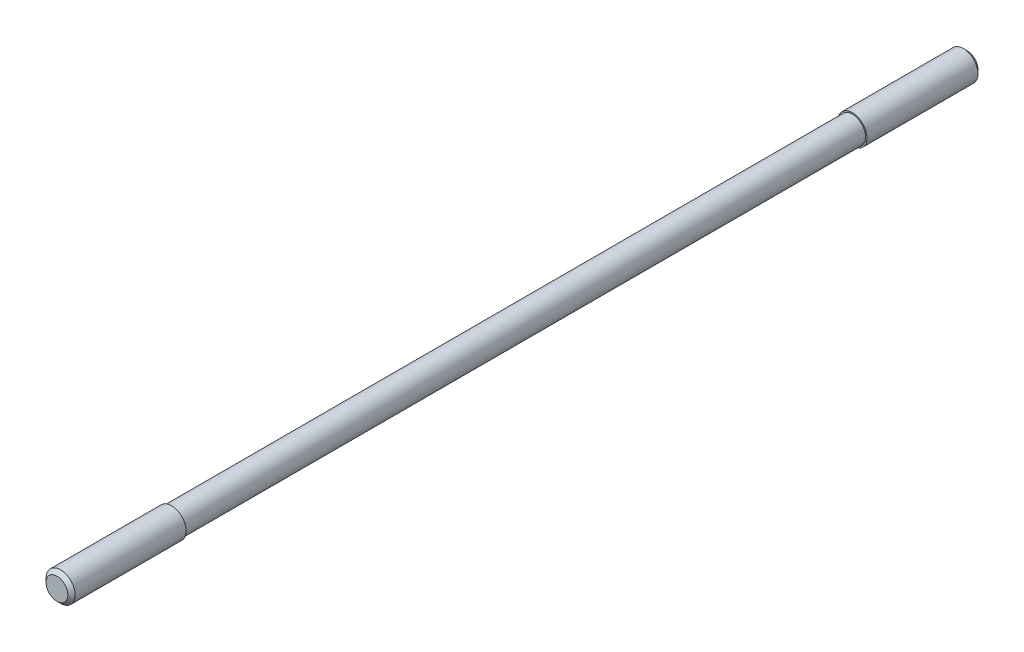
ISO-10303-21;
HEADER;
FILE_DESCRIPTION(('STEP AP214'),'2;1');
FILE_NAME('part.step','',(''),(''),'','','');
FILE_SCHEMA(('AUTOMOTIVE_DESIGN { 1 0 10303 214 1 1 1 1 }'));
ENDSEC;
DATA;
#1=APPLICATION_CONTEXT('core data for automotive mechanical design processes');
#2=APPLICATION_PROTOCOL_DEFINITION('international standard','automotive_design',2000,#1);
#3=PRODUCT_CONTEXT('',#1,'mechanical');
#4=PRODUCT('Part','Part','',(#3));
#5=PRODUCT_RELATED_PRODUCT_CATEGORY('part','',(#4));
#6=PRODUCT_DEFINITION_FORMATION('','',#4);
#7=PRODUCT_DEFINITION_CONTEXT('part definition',#1,'design');
#8=PRODUCT_DEFINITION('design','',#6,#7);
#9=PRODUCT_DEFINITION_SHAPE('','',#8);
#10=(LENGTH_UNIT() NAMED_UNIT(*) SI_UNIT(.MILLI.,.METRE.));
#11=(NAMED_UNIT(*) PLANE_ANGLE_UNIT() SI_UNIT($,.RADIAN.));
#12=(NAMED_UNIT(*) SI_UNIT($,.STERADIAN.) SOLID_ANGLE_UNIT());
#13=UNCERTAINTY_MEASURE_WITH_UNIT(LENGTH_MEASURE(1.E-05),#10,'distance_accuracy_value','');
#14=(GEOMETRIC_REPRESENTATION_CONTEXT(3) GLOBAL_UNCERTAINTY_ASSIGNED_CONTEXT((#13)) GLOBAL_UNIT_ASSIGNED_CONTEXT((#10,
#11,#12)) REPRESENTATION_CONTEXT('',''));
#15=CARTESIAN_POINT('',(0.,0.,0.));
#16=DIRECTION('',(0.,0.,1.));
#17=DIRECTION('',(1.,0.,0.));
#18=AXIS2_PLACEMENT_3D('',#15,#16,#17);
#19=CARTESIAN_POINT('',(0.,0.,0.));
#20=DIRECTION('',(0.,0.,1.));
#21=DIRECTION('',(1.,0.,0.));
#22=AXIS2_PLACEMENT_3D('',#19,#20,#21);
#23=PLANE('',#22);
#24=CARTESIAN_POINT('',(0.,0.,0.));
#25=DIRECTION('',(0.,0.,1.));
#26=DIRECTION('',(1.,0.,0.));
#27=AXIS2_PLACEMENT_3D('',#24,#25,#26);
#28=CIRCLE('',#27,6.);
#29=CARTESIAN_POINT('',(6.,0.,0.));
#30=VERTEX_POINT('',#29);
#31=EDGE_CURVE('E8',#30,#30,#28,.T.);
#32=ORIENTED_EDGE('',*,*,#31,.F.);
#33=EDGE_LOOP('',(#32));
#34=FACE_BOUND('',#33,.T.);
#35=ADVANCED_FACE('F12',(#34),#23,.F.);
#36=CARTESIAN_POINT('',(0.,0.,2.));
#37=DIRECTION('',(0.,0.,1.));
#38=DIRECTION('',(1.,0.,0.));
#39=AXIS2_PLACEMENT_3D('',#36,#37,#38);
#40=CONICAL_SURFACE('',#39,8.,0.785398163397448);
#41=ORIENTED_EDGE('',*,*,#31,.T.);
#42=EDGE_LOOP('',(#41));
#43=FACE_BOUND('',#42,.T.);
#44=CARTESIAN_POINT('',(0.,0.,2.));
#45=DIRECTION('',(0.,0.,1.));
#46=DIRECTION('',(1.,0.,0.));
#47=AXIS2_PLACEMENT_3D('',#44,#45,#46);
#48=CIRCLE('',#47,8.);
#49=CARTESIAN_POINT('',(8.,0.,2.));
#50=VERTEX_POINT('',#49);
#51=EDGE_CURVE('E18',#50,#50,#48,.T.);
#52=ORIENTED_EDGE('',*,*,#51,.F.);
#53=EDGE_LOOP('',(#52));
#54=FACE_BOUND('',#53,.T.);
#55=ADVANCED_FACE('F61',(#43,#54),#40,.T.);
#56=CARTESIAN_POINT('',(0.,0.,70.));
#57=DIRECTION('',(0.,0.,1.));
#58=DIRECTION('',(1.,0.,0.));
#59=AXIS2_PLACEMENT_3D('',#56,#57,#58);
#60=CYLINDRICAL_SURFACE('',#59,8.);
#61=CARTESIAN_POINT('',(0.,0.,63.));
#62=DIRECTION('',(0.,0.,1.));
#63=DIRECTION('',(1.,0.,0.));
#64=AXIS2_PLACEMENT_3D('',#61,#62,#63);
#65=CIRCLE('',#64,8.);
#66=CARTESIAN_POINT('',(8.,0.,63.));
#67=VERTEX_POINT('',#66);
#68=EDGE_CURVE('E22',#67,#67,#65,.T.);
#69=ORIENTED_EDGE('',*,*,#68,.F.);
#70=EDGE_LOOP('',(#69));
#71=FACE_BOUND('',#70,.T.);
#72=ORIENTED_EDGE('',*,*,#51,.T.);
#73=EDGE_LOOP('',(#72));
#74=FACE_BOUND('',#73,.T.);
#75=ADVANCED_FACE('F66',(#71,#74),#60,.T.);
#76=CARTESIAN_POINT('',(8.,0.,63.));
#77=DIRECTION('',(0.,0.,-1.));
#78=DIRECTION('',(-1.,0.,0.));
#79=AXIS2_PLACEMENT_3D('',#76,#77,#78);
#80=PLANE('',#79);
#81=CARTESIAN_POINT('',(0.,0.,63.));
#82=DIRECTION('',(0.,0.,1.));
#83=DIRECTION('',(1.,0.,0.));
#84=AXIS2_PLACEMENT_3D('',#81,#82,#83);
#85=CIRCLE('',#84,7.25);
#86=CARTESIAN_POINT('',(7.25,0.,63.));
#87=VERTEX_POINT('',#86);
#88=EDGE_CURVE('E26',#87,#87,#85,.T.);
#89=ORIENTED_EDGE('',*,*,#88,.F.);
#90=EDGE_LOOP('',(#89));
#91=FACE_BOUND('',#90,.T.);
#92=ORIENTED_EDGE('',*,*,#68,.T.);
#93=EDGE_LOOP('',(#92));
#94=FACE_BOUND('',#93,.T.);
#95=ADVANCED_FACE('F70',(#91,#94),#80,.F.);
#96=CARTESIAN_POINT('',(0.,0.,70.));
#97=DIRECTION('',(0.,0.,1.));
#98=DIRECTION('',(1.,0.,0.));
#99=AXIS2_PLACEMENT_3D('',#96,#97,#98);
#100=CYLINDRICAL_SURFACE('',#99,7.25);
#101=CARTESIAN_POINT('',(0.,0.,437.));
#102=DIRECTION('',(0.,0.,1.));
#103=DIRECTION('',(1.,0.,0.));
#104=AXIS2_PLACEMENT_3D('',#101,#102,#103);
#105=CIRCLE('',#104,7.25);
#106=CARTESIAN_POINT('',(7.25,0.,437.));
#107=VERTEX_POINT('',#106);
#108=EDGE_CURVE('E31',#107,#107,#105,.T.);
#109=ORIENTED_EDGE('',*,*,#108,.F.);
#110=EDGE_LOOP('',(#109));
#111=FACE_BOUND('',#110,.T.);
#112=ORIENTED_EDGE('',*,*,#88,.T.);
#113=EDGE_LOOP('',(#112));
#114=FACE_BOUND('',#113,.T.);
#115=ADVANCED_FACE('F77',(#111,#114),#100,.T.);
#116=CARTESIAN_POINT('',(7.25,0.,437.));
#117=DIRECTION('',(0.,0.,1.));
#118=DIRECTION('',(1.,0.,0.));
#119=AXIS2_PLACEMENT_3D('',#116,#117,#118);
#120=PLANE('',#119);
#121=CARTESIAN_POINT('',(0.,0.,437.));
#122=DIRECTION('',(0.,0.,1.));
#123=DIRECTION('',(1.,0.,0.));
#124=AXIS2_PLACEMENT_3D('',#121,#122,#123);
#125=CIRCLE('',#124,8.);
#126=CARTESIAN_POINT('',(8.,0.,437.));
#127=VERTEX_POINT('',#126);
#128=EDGE_CURVE('E34',#127,#127,#125,.T.);
#129=ORIENTED_EDGE('',*,*,#128,.F.);
#130=EDGE_LOOP('',(#129));
#131=FACE_BOUND('',#130,.T.);
#132=ORIENTED_EDGE('',*,*,#108,.T.);
#133=EDGE_LOOP('',(#132));
#134=FACE_BOUND('',#133,.T.);
#135=ADVANCED_FACE('F57',(#131,#134),#120,.F.);
#136=CARTESIAN_POINT('',(0.,0.,70.));
#137=DIRECTION('',(0.,0.,1.));
#138=DIRECTION('',(1.,0.,0.));
#139=AXIS2_PLACEMENT_3D('',#136,#137,#138);
#140=CYLINDRICAL_SURFACE('',#139,8.);
#141=CARTESIAN_POINT('',(0.,0.,498.));
#142=DIRECTION('',(0.,0.,1.));
#143=DIRECTION('',(1.,0.,0.));
#144=AXIS2_PLACEMENT_3D('',#141,#142,#143);
#145=CIRCLE('',#144,8.);
#146=CARTESIAN_POINT('',(8.,0.,498.));
#147=VERTEX_POINT('',#146);
#148=EDGE_CURVE('E37',#147,#147,#145,.T.);
#149=ORIENTED_EDGE('',*,*,#148,.F.);
#150=EDGE_LOOP('',(#149));
#151=FACE_BOUND('',#150,.T.);
#152=ORIENTED_EDGE('',*,*,#128,.T.);
#153=EDGE_LOOP('',(#152));
#154=FACE_BOUND('',#153,.T.);
#155=ADVANCED_FACE('F48',(#151,#154),#140,.T.);
#156=CARTESIAN_POINT('',(0.,0.,500.));
#157=DIRECTION('',(0.,0.,-1.));
#158=DIRECTION('',(-1.,0.,0.));
#159=AXIS2_PLACEMENT_3D('',#156,#157,#158);
#160=CONICAL_SURFACE('',#159,6.,0.785398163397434);
#161=ORIENTED_EDGE('',*,*,#148,.T.);
#162=EDGE_LOOP('',(#161));
#163=FACE_BOUND('',#162,.T.);
#164=CARTESIAN_POINT('',(0.,0.,500.));
#165=DIRECTION('',(0.,0.,1.));
#166=DIRECTION('',(1.,0.,0.));
#167=AXIS2_PLACEMENT_3D('',#164,#165,#166);
#168=CIRCLE('',#167,6.);
#169=CARTESIAN_POINT('',(6.,0.,500.));
#170=VERTEX_POINT('',#169);
#171=EDGE_CURVE('E40',#170,#170,#168,.T.);
#172=ORIENTED_EDGE('',*,*,#171,.F.);
#173=EDGE_LOOP('',(#172));
#174=FACE_BOUND('',#173,.T.);
#175=ADVANCED_FACE('F46',(#163,#174),#160,.T.);
#176=CARTESIAN_POINT('',(6.,0.,500.));
#177=DIRECTION('',(0.,0.,-1.));
#178=DIRECTION('',(-1.,0.,0.));
#179=AXIS2_PLACEMENT_3D('',#176,#177,#178);
#180=PLANE('',#179);
#181=ORIENTED_EDGE('',*,*,#171,.T.);
#182=EDGE_LOOP('',(#181));
#183=FACE_BOUND('',#182,.T.);
#184=ADVANCED_FACE('F44',(#183),#180,.F.);
#185=CLOSED_SHELL('',(#35,#55,#75,#95,#115,#135,#155,#175,#184));
#186=MANIFOLD_SOLID_BREP('B1',#185);
#187=ADVANCED_BREP_SHAPE_REPRESENTATION('',(#18,#186),#14);
#188=SHAPE_DEFINITION_REPRESENTATION(#9,#187);
ENDSEC;
END-ISO-10303-21;
